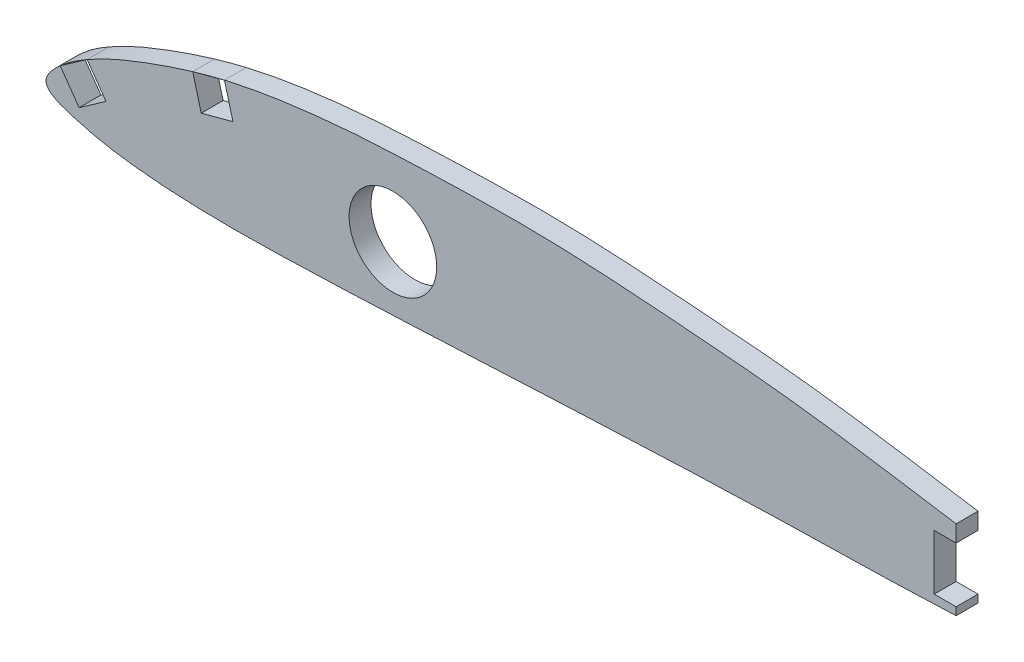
ISO-10303-21;
HEADER;
FILE_DESCRIPTION(('STEP AP214'),'2;1');
FILE_NAME('part.step','',(''),(''),'','','');
FILE_SCHEMA(('AUTOMOTIVE_DESIGN { 1 0 10303 214 1 1 1 1 }'));
ENDSEC;
DATA;
#1=APPLICATION_CONTEXT('core data for automotive mechanical design processes');
#2=APPLICATION_PROTOCOL_DEFINITION('international standard','automotive_design',2000,#1);
#3=PRODUCT_CONTEXT('',#1,'mechanical');
#4=PRODUCT('Part','Part','',(#3));
#5=PRODUCT_RELATED_PRODUCT_CATEGORY('part','',(#4));
#6=PRODUCT_DEFINITION_FORMATION('','',#4);
#7=PRODUCT_DEFINITION_CONTEXT('part definition',#1,'design');
#8=PRODUCT_DEFINITION('design','',#6,#7);
#9=PRODUCT_DEFINITION_SHAPE('','',#8);
#10=(LENGTH_UNIT() NAMED_UNIT(*) SI_UNIT(.MILLI.,.METRE.));
#11=(NAMED_UNIT(*) PLANE_ANGLE_UNIT() SI_UNIT($,.RADIAN.));
#12=(NAMED_UNIT(*) SI_UNIT($,.STERADIAN.) SOLID_ANGLE_UNIT());
#13=UNCERTAINTY_MEASURE_WITH_UNIT(LENGTH_MEASURE(1.E-05),#10,'distance_accuracy_value','');
#14=(GEOMETRIC_REPRESENTATION_CONTEXT(3) GLOBAL_UNCERTAINTY_ASSIGNED_CONTEXT((#13)) GLOBAL_UNIT_ASSIGNED_CONTEXT((#10,
#11,#12)) REPRESENTATION_CONTEXT('',''));
#15=CARTESIAN_POINT('',(0.,0.,0.));
#16=DIRECTION('',(0.,0.,1.));
#17=DIRECTION('',(1.,0.,0.));
#18=AXIS2_PLACEMENT_3D('',#15,#16,#17);
#19=CARTESIAN_POINT('',(0.,0.,0.));
#20=DIRECTION('',(0.,0.,-1.));
#21=DIRECTION('',(-1.,0.,0.));
#22=AXIS2_PLACEMENT_3D('',#19,#20,#21);
#23=PLANE('',#22);
#24=DIRECTION('',(0.,1.,0.));
#25=VECTOR('',#24,1.);
#26=CARTESIAN_POINT('',(131.992,0.,0.));
#27=LINE('',#26,#25);
#28=CARTESIAN_POINT('',(131.992,7.99999999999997,0.));
#29=VERTEX_POINT('',#28);
#30=CARTESIAN_POINT('',(131.992,10.419422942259,0.));
#31=VERTEX_POINT('',#30);
#32=EDGE_CURVE('E201',#29,#31,#27,.T.);
#33=ORIENTED_EDGE('',*,*,#32,.F.);
#34=DIRECTION('',(1.,0.,0.));
#35=VECTOR('',#34,1.);
#36=CARTESIAN_POINT('',(0.,7.99999999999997,0.));
#37=LINE('',#36,#35);
#38=CARTESIAN_POINT('',(128.817,7.99999999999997,0.));
#39=VERTEX_POINT('',#38);
#40=EDGE_CURVE('E64',#39,#29,#37,.T.);
#41=ORIENTED_EDGE('',*,*,#40,.F.);
#42=DIRECTION('',(0.,1.,0.));
#43=VECTOR('',#42,1.);
#44=CARTESIAN_POINT('',(128.817,0.,0.));
#45=LINE('',#44,#43);
#46=CARTESIAN_POINT('',(128.817,0.,0.));
#47=VERTEX_POINT('',#46);
#48=EDGE_CURVE('E190',#47,#39,#45,.T.);
#49=ORIENTED_EDGE('',*,*,#48,.F.);
#50=DIRECTION('',(-1.,0.,0.));
#51=VECTOR('',#50,1.);
#52=CARTESIAN_POINT('',(0.,0.,0.));
#53=LINE('',#52,#51);
#54=CARTESIAN_POINT('',(131.992,0.,0.));
#55=VERTEX_POINT('',#54);
#56=EDGE_CURVE('E133',#55,#47,#53,.T.);
#57=ORIENTED_EDGE('',*,*,#56,.F.);
#58=DIRECTION('',(0.,1.,0.));
#59=VECTOR('',#58,1.);
#60=CARTESIAN_POINT('',(131.992,0.,0.));
#61=LINE('',#60,#59);
#62=CARTESIAN_POINT('',(131.992,-1.12472959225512,0.));
#63=VERTEX_POINT('',#62);
#64=EDGE_CURVE('E196',#63,#55,#61,.T.);
#65=ORIENTED_EDGE('',*,*,#64,.F.);
#66=CARTESIAN_POINT('',(0.,0.,0.));
#67=CARTESIAN_POINT('',(-0.0497615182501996,0.966343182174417,0.));
#68=CARTESIAN_POINT('',(2.06035689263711,3.13560254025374,0.));
#69=CARTESIAN_POINT('',(5.05737649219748,5.28209114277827,0.));
#70=CARTESIAN_POINT('',(8.94173703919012,7.37378373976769,0.));
#71=CARTESIAN_POINT('',(16.3804299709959,10.3996324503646,0.));
#72=CARTESIAN_POINT('',(25.4040046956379,13.2786446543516,0.));
#73=CARTESIAN_POINT('',(36.0853642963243,14.9867828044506,0.));
#74=CARTESIAN_POINT('',(45.1384362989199,15.8902490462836,0.));
#75=CARTESIAN_POINT('',(57.1889611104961,16.3952873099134,0.));
#76=CARTESIAN_POINT('',(72.2672780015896,16.822951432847,0.));
#77=CARTESIAN_POINT('',(90.3138876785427,15.5563635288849,0.));
#78=CARTESIAN_POINT('',(108.490792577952,14.1400208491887,0.));
#79=CARTESIAN_POINT('',(126.255248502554,11.2942907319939,0.));
#80=CARTESIAN_POINT('',(145.311705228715,8.38102536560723,0.));
#81=CARTESIAN_POINT('',(159.854892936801,4.95966623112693,0.));
#82=CARTESIAN_POINT('',(190.812648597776,-1.1725038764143,0.));
#83=CARTESIAN_POINT('',(150.756480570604,0.23836985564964,0.));
#84=CARTESIAN_POINT('',(133.337000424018,-1.35578957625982,0.));
#85=CARTESIAN_POINT('',(95.7330391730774,-1.94857406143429,0.));
#86=CARTESIAN_POINT('',(66.3381494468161,-3.55026856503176,0.));
#87=CARTESIAN_POINT('',(36.0734980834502,-4.86947617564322,0.));
#88=CARTESIAN_POINT('',(21.2000389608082,-5.11335903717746,0.));
#89=CARTESIAN_POINT('',(10.2524510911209,-4.05305199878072,0.));
#90=CARTESIAN_POINT('',(4.67919825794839,-2.77873170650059,0.));
#91=CARTESIAN_POINT('',(0.0682857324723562,-1.32607392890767,0.));
#92=CARTESIAN_POINT('',(0.,0.,0.));
#93=B_SPLINE_CURVE_WITH_KNOTS('',3,(#66,#67,#68,#69,#70,#71,#72,#73,#74,#75,#76,#77,#78,#79,#80,
#81,#82,#83,#84,#85,#86,#87,#88,#89,#90,#91,#92),.UNSPECIFIED.,.T.,.F.,(4,1,1,1,1,1,1,1,1,1,1,1,
1,1,1,1,1,1,1,1,1,1,1,1,4),(0.,0.0105604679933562,0.0182111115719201,0.0322098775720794,
0.0455249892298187,0.0840694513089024,0.10897429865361,0.133649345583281,0.158232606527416,
0.207343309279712,0.25652270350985,0.30582635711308,0.355445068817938,0.40521420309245,
0.4553904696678,0.506006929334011,0.555121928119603,0.653369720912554,0.702490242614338,
0.849938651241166,0.899083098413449,0.948194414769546,0.972905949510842,0.985508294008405,1.),.UNSPECIFIED.);
#94=CARTESIAN_POINT('',(2.0644061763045,2.99155451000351,0.));
#95=VERTEX_POINT('',#94);
#96=EDGE_CURVE('E205',#63,#95,#93,.T.);
#97=ORIENTED_EDGE('',*,*,#96,.T.);
#98=DIRECTION('',(-0.573576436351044,0.819152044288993,0.));
#99=VECTOR('',#98,1.);
#100=CARTESIAN_POINT('',(2.79080818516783,1.95414492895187,0.));
#101=LINE('',#100,#99);
#102=CARTESIAN_POINT('',(4.79606395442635,-0.909657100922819,0.));
#103=VERTEX_POINT('',#102);
#104=EDGE_CURVE('E159',#103,#95,#101,.T.);
#105=ORIENTED_EDGE('',*,*,#104,.F.);
#106=DIRECTION('',(-0.819152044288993,-0.573576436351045,0.));
#107=VECTOR('',#106,1.);
#108=CARTESIAN_POINT('',(2.00525576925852,-2.86380202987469,0.));
#109=LINE('',#108,#107);
#110=CARTESIAN_POINT('',(8.69727556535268,1.82200067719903,0.));
#111=VERTEX_POINT('',#110);
#112=EDGE_CURVE('E248',#111,#103,#109,.T.);
#113=ORIENTED_EDGE('',*,*,#112,.F.);
#114=DIRECTION('',(0.573576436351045,-0.819152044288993,0.));
#115=VECTOR('',#114,1.);
#116=CARTESIAN_POINT('',(6.69201979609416,4.68580270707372,0.));
#117=LINE('',#116,#115);
#118=CARTESIAN_POINT('',(5.96561778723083,5.72321228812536,0.));
#119=VERTEX_POINT('',#118);
#120=EDGE_CURVE('E179',#119,#111,#117,.T.);
#121=ORIENTED_EDGE('',*,*,#120,.F.);
#122=CARTESIAN_POINT('',(21.2823260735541,11.8553995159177,0.));
#123=VERTEX_POINT('',#122);
#124=EDGE_CURVE('E210',#119,#123,#93,.T.);
#125=ORIENTED_EDGE('',*,*,#124,.T.);
#126=DIRECTION('',(-0.258819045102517,0.965925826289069,0.));
#127=VECTOR('',#126,1.);
#128=CARTESIAN_POINT('',(22.8205304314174,6.11474269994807,0.));
#129=LINE('',#128,#127);
#130=CARTESIAN_POINT('',(22.5149517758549,7.25517776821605,0.));
#131=VERTEX_POINT('',#130);
#132=EDGE_CURVE('E237',#131,#123,#129,.T.);
#133=ORIENTED_EDGE('',*,*,#132,.F.);
#134=DIRECTION('',(-0.965925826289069,-0.258819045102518,0.));
#135=VECTOR('',#134,1.);
#136=CARTESIAN_POINT('',(-0.30557865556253,1.14043506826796,0.));
#137=LINE('',#136,#135);
#138=CARTESIAN_POINT('',(27.1151735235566,8.4878034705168,0.));
#139=VERTEX_POINT('',#138);
#140=EDGE_CURVE('E252',#139,#131,#137,.T.);
#141=ORIENTED_EDGE('',*,*,#140,.F.);
#142=DIRECTION('',(0.258819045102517,-0.965925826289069,0.));
#143=VECTOR('',#142,1.);
#144=CARTESIAN_POINT('',(27.4207521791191,7.34736840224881,0.));
#145=LINE('',#144,#143);
#146=CARTESIAN_POINT('',(25.8825478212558,13.0880252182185,0.));
#147=VERTEX_POINT('',#146);
#148=EDGE_CURVE('E261',#147,#139,#145,.T.);
#149=ORIENTED_EDGE('',*,*,#148,.F.);
#150=EDGE_CURVE('E211',#147,#31,#93,.T.);
#151=ORIENTED_EDGE('',*,*,#150,.T.);
#152=EDGE_LOOP('',(#33,#41,#49,#57,#65,#97,#105,#113,#121,#125,#133,#141,#149,#151));
#153=FACE_BOUND('',#152,.T.);
#154=CARTESIAN_POINT('',(50.31,4.99999999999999,0.));
#155=DIRECTION('',(0.,0.,-1.));
#156=DIRECTION('',(-1.,0.,0.));
#157=AXIS2_PLACEMENT_3D('',#154,#155,#156);
#158=CIRCLE('',#157,6.35);
#159=CARTESIAN_POINT('',(43.96,4.99999999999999,0.));
#160=VERTEX_POINT('',#159);
#161=EDGE_CURVE('E238',#160,#160,#158,.T.);
#162=ORIENTED_EDGE('',*,*,#161,.F.);
#163=EDGE_LOOP('',(#162));
#164=FACE_BOUND('',#163,.T.);
#165=ADVANCED_FACE('F44',(#153,#164),#23,.T.);
#166=CARTESIAN_POINT('',(0.,0.,3.175));
#167=DIRECTION('',(0.,0.,-1.));
#168=DIRECTION('',(-1.,0.,0.));
#169=AXIS2_PLACEMENT_3D('',#166,#167,#168);
#170=PLANE('',#169);
#171=CARTESIAN_POINT('',(50.31,4.99999999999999,3.175));
#172=DIRECTION('',(0.,0.,1.));
#173=DIRECTION('',(1.,0.,0.));
#174=AXIS2_PLACEMENT_3D('',#171,#172,#173);
#175=CIRCLE('',#174,6.35);
#176=CARTESIAN_POINT('',(56.66,4.99999999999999,3.175));
#177=VERTEX_POINT('',#176);
#178=EDGE_CURVE('E235',#177,#177,#175,.T.);
#179=ORIENTED_EDGE('',*,*,#178,.F.);
#180=EDGE_LOOP('',(#179));
#181=FACE_BOUND('',#180,.T.);
#182=DIRECTION('',(-1.,0.,0.));
#183=VECTOR('',#182,1.);
#184=CARTESIAN_POINT('',(128.817,7.99999999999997,3.175));
#185=LINE('',#184,#183);
#186=CARTESIAN_POINT('',(131.992,7.99999999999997,3.175));
#187=VERTEX_POINT('',#186);
#188=CARTESIAN_POINT('',(128.817,7.99999999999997,3.175));
#189=VERTEX_POINT('',#188);
#190=EDGE_CURVE('E13',#187,#189,#185,.T.);
#191=ORIENTED_EDGE('',*,*,#190,.F.);
#192=DIRECTION('',(0.,-1.,0.));
#193=VECTOR('',#192,1.);
#194=CARTESIAN_POINT('',(131.992,16.0032119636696,3.175));
#195=LINE('',#194,#193);
#196=CARTESIAN_POINT('',(131.992,10.419422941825,3.175));
#197=VERTEX_POINT('',#196);
#198=EDGE_CURVE('E200',#197,#187,#195,.T.);
#199=ORIENTED_EDGE('',*,*,#198,.F.);
#200=CARTESIAN_POINT('',(0.,0.,3.175));
#201=CARTESIAN_POINT('',(-0.0497615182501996,0.966343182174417,3.175));
#202=CARTESIAN_POINT('',(2.06035689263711,3.13560254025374,3.175));
#203=CARTESIAN_POINT('',(5.05737649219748,5.28209114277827,3.175));
#204=CARTESIAN_POINT('',(8.94173703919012,7.37378373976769,3.175));
#205=CARTESIAN_POINT('',(16.3804299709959,10.3996324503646,3.175));
#206=CARTESIAN_POINT('',(25.4040046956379,13.2786446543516,3.175));
#207=CARTESIAN_POINT('',(36.0853642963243,14.9867828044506,3.175));
#208=CARTESIAN_POINT('',(45.1384362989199,15.8902490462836,3.175));
#209=CARTESIAN_POINT('',(57.1889611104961,16.3952873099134,3.175));
#210=CARTESIAN_POINT('',(72.2672780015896,16.822951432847,3.175));
#211=CARTESIAN_POINT('',(90.3138876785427,15.5563635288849,3.175));
#212=CARTESIAN_POINT('',(108.490792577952,14.1400208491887,3.175));
#213=CARTESIAN_POINT('',(126.255248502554,11.2942907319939,3.175));
#214=CARTESIAN_POINT('',(145.311705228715,8.38102536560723,3.175));
#215=CARTESIAN_POINT('',(159.854892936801,4.95966623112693,3.175));
#216=CARTESIAN_POINT('',(190.812648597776,-1.1725038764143,3.175));
#217=CARTESIAN_POINT('',(150.756480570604,0.23836985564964,3.175));
#218=CARTESIAN_POINT('',(133.337000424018,-1.35578957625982,3.175));
#219=CARTESIAN_POINT('',(95.7330391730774,-1.94857406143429,3.175));
#220=CARTESIAN_POINT('',(66.3381494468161,-3.55026856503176,3.175));
#221=CARTESIAN_POINT('',(36.0734980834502,-4.86947617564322,3.175));
#222=CARTESIAN_POINT('',(21.2000389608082,-5.11335903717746,3.175));
#223=CARTESIAN_POINT('',(10.2524510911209,-4.05305199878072,3.175));
#224=CARTESIAN_POINT('',(4.67919825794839,-2.77873170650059,3.175));
#225=CARTESIAN_POINT('',(0.0682857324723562,-1.32607392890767,3.175));
#226=CARTESIAN_POINT('',(0.,0.,3.175));
#227=B_SPLINE_CURVE_WITH_KNOTS('',3,(#200,#201,#202,#203,#204,#205,#206,#207,#208,#209,#210,
#211,#212,#213,#214,#215,#216,#217,#218,#219,#220,#221,#222,#223,#224,#225,#226),.UNSPECIFIED.,
.T.,.F.,(4,1,1,1,1,1,1,1,1,1,1,1,1,1,1,1,1,1,1,1,1,1,1,1,4),(0.,0.0105604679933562,
0.0182111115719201,0.0322098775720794,0.0455249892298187,0.0840694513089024,0.10897429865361,
0.133649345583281,0.158232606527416,0.207343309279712,0.25652270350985,0.30582635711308,
0.355445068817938,0.40521420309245,0.4553904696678,0.506006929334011,0.555121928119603,
0.653369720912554,0.702490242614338,0.849938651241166,0.899083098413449,0.948194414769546,
0.972905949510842,0.985508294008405,1.),.UNSPECIFIED.);
#228=CARTESIAN_POINT('',(25.8825478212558,13.0880252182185,3.175));
#229=VERTEX_POINT('',#228);
#230=EDGE_CURVE('E172',#229,#197,#227,.T.);
#231=ORIENTED_EDGE('',*,*,#230,.F.);
#232=DIRECTION('',(-0.258819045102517,0.965925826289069,0.));
#233=VECTOR('',#232,1.);
#234=CARTESIAN_POINT('',(25.8825478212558,13.0880252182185,3.175));
#235=LINE('',#234,#233);
#236=CARTESIAN_POINT('',(27.1151735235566,8.4878034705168,3.175));
#237=VERTEX_POINT('',#236);
#238=EDGE_CURVE('E255',#237,#229,#235,.T.);
#239=ORIENTED_EDGE('',*,*,#238,.F.);
#240=DIRECTION('',(0.965925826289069,0.258819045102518,0.));
#241=VECTOR('',#240,1.);
#242=CARTESIAN_POINT('',(22.5149517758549,7.25517776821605,3.175));
#243=LINE('',#242,#241);
#244=CARTESIAN_POINT('',(22.5149517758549,7.25517776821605,3.175));
#245=VERTEX_POINT('',#244);
#246=EDGE_CURVE('E259',#245,#237,#243,.T.);
#247=ORIENTED_EDGE('',*,*,#246,.F.);
#248=DIRECTION('',(0.258819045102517,-0.965925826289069,0.));
#249=VECTOR('',#248,1.);
#250=CARTESIAN_POINT('',(21.2823260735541,11.8553995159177,3.175));
#251=LINE('',#250,#249);
#252=CARTESIAN_POINT('',(21.2823260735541,11.8553995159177,3.175));
#253=VERTEX_POINT('',#252);
#254=EDGE_CURVE('E264',#253,#245,#251,.T.);
#255=ORIENTED_EDGE('',*,*,#254,.F.);
#256=CARTESIAN_POINT('',(5.96561778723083,5.72321228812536,3.175));
#257=VERTEX_POINT('',#256);
#258=EDGE_CURVE('E173',#257,#253,#227,.T.);
#259=ORIENTED_EDGE('',*,*,#258,.F.);
#260=DIRECTION('',(-0.573576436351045,0.819152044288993,0.));
#261=VECTOR('',#260,1.);
#262=CARTESIAN_POINT('',(5.96561778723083,5.72321228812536,3.175));
#263=LINE('',#262,#261);
#264=CARTESIAN_POINT('',(8.69727556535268,1.82200067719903,3.175));
#265=VERTEX_POINT('',#264);
#266=EDGE_CURVE('E251',#265,#257,#263,.T.);
#267=ORIENTED_EDGE('',*,*,#266,.F.);
#268=DIRECTION('',(0.819152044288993,0.573576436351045,0.));
#269=VECTOR('',#268,1.);
#270=CARTESIAN_POINT('',(4.79606395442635,-0.909657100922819,3.175));
#271=LINE('',#270,#269);
#272=CARTESIAN_POINT('',(4.79606395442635,-0.909657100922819,3.175));
#273=VERTEX_POINT('',#272);
#274=EDGE_CURVE('E178',#273,#265,#271,.T.);
#275=ORIENTED_EDGE('',*,*,#274,.F.);
#276=DIRECTION('',(0.573576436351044,-0.819152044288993,0.));
#277=VECTOR('',#276,1.);
#278=CARTESIAN_POINT('',(2.0644061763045,2.99155451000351,3.175));
#279=LINE('',#278,#277);
#280=CARTESIAN_POINT('',(2.0644061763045,2.99155451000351,3.175));
#281=VERTEX_POINT('',#280);
#282=EDGE_CURVE('E156',#281,#273,#279,.T.);
#283=ORIENTED_EDGE('',*,*,#282,.F.);
#284=CARTESIAN_POINT('',(131.992000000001,-1.12472959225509,3.175));
#285=VERTEX_POINT('',#284);
#286=EDGE_CURVE('E166',#285,#281,#227,.T.);
#287=ORIENTED_EDGE('',*,*,#286,.F.);
#288=DIRECTION('',(0.,-1.,0.));
#289=VECTOR('',#288,1.);
#290=CARTESIAN_POINT('',(131.992,0.,3.175));
#291=LINE('',#290,#289);
#292=CARTESIAN_POINT('',(131.992,0.,3.175));
#293=VERTEX_POINT('',#292);
#294=EDGE_CURVE('E195',#293,#285,#291,.T.);
#295=ORIENTED_EDGE('',*,*,#294,.F.);
#296=DIRECTION('',(1.,0.,0.));
#297=VECTOR('',#296,1.);
#298=CARTESIAN_POINT('',(128.817,0.,3.175));
#299=LINE('',#298,#297);
#300=CARTESIAN_POINT('',(128.817,0.,3.175));
#301=VERTEX_POINT('',#300);
#302=EDGE_CURVE('E192',#301,#293,#299,.T.);
#303=ORIENTED_EDGE('',*,*,#302,.F.);
#304=DIRECTION('',(0.,-1.,0.));
#305=VECTOR('',#304,1.);
#306=CARTESIAN_POINT('',(128.817,7.99999999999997,3.175));
#307=LINE('',#306,#305);
#308=EDGE_CURVE('E189',#189,#301,#307,.T.);
#309=ORIENTED_EDGE('',*,*,#308,.F.);
#310=EDGE_LOOP('',(#191,#199,#231,#239,#247,#255,#259,#267,#275,#283,#287,#295,#303,#309));
#311=FACE_BOUND('',#310,.T.);
#312=ADVANCED_FACE('F175',(#181,#311),#170,.F.);
#313=DIRECTION('',(0.,0.,1.));
#314=VECTOR('',#313,1.);
#315=SURFACE_OF_LINEAR_EXTRUSION('',#93,#314);
#316=ORIENTED_EDGE('',*,*,#230,.T.);
#317=DIRECTION('',(0.,0.,1.));
#318=VECTOR('',#317,1.);
#319=CARTESIAN_POINT('',(131.992,10.419422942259,0.));
#320=LINE('',#319,#318);
#321=EDGE_CURVE('E287',#197,#31,#320,.F.);
#322=ORIENTED_EDGE('',*,*,#321,.T.);
#323=ORIENTED_EDGE('',*,*,#150,.F.);
#324=DIRECTION('',(0.,0.,1.));
#325=VECTOR('',#324,1.);
#326=CARTESIAN_POINT('',(25.8825478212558,13.0880252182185,0.));
#327=LINE('',#326,#325);
#328=EDGE_CURVE('E212',#147,#229,#327,.T.);
#329=ORIENTED_EDGE('',*,*,#328,.T.);
#330=EDGE_LOOP('',(#316,#322,#323,#329));
#331=FACE_BOUND('',#330,.T.);
#332=ADVANCED_FACE('F222',(#331),#315,.F.);
#333=ORIENTED_EDGE('',*,*,#96,.F.);
#334=DIRECTION('',(0.,0.,1.));
#335=VECTOR('',#334,1.);
#336=CARTESIAN_POINT('',(131.992,-1.12472959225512,0.));
#337=LINE('',#336,#335);
#338=EDGE_CURVE('E168',#63,#285,#337,.T.);
#339=ORIENTED_EDGE('',*,*,#338,.T.);
#340=ORIENTED_EDGE('',*,*,#286,.T.);
#341=DIRECTION('',(0.,0.,1.));
#342=VECTOR('',#341,1.);
#343=CARTESIAN_POINT('',(2.06440617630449,2.9915545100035,0.));
#344=LINE('',#343,#342);
#345=EDGE_CURVE('E151',#95,#281,#344,.T.);
#346=ORIENTED_EDGE('',*,*,#345,.F.);
#347=EDGE_LOOP('',(#333,#339,#340,#346));
#348=FACE_BOUND('',#347,.T.);
#349=ADVANCED_FACE('F167',(#348),#315,.F.);
#350=ORIENTED_EDGE('',*,*,#124,.F.);
#351=DIRECTION('',(0.,0.,1.));
#352=VECTOR('',#351,1.);
#353=CARTESIAN_POINT('',(5.96561778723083,5.72321228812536,0.));
#354=LINE('',#353,#352);
#355=EDGE_CURVE('E171',#119,#257,#354,.T.);
#356=ORIENTED_EDGE('',*,*,#355,.T.);
#357=ORIENTED_EDGE('',*,*,#258,.T.);
#358=DIRECTION('',(0.,0.,1.));
#359=VECTOR('',#358,1.);
#360=CARTESIAN_POINT('',(21.2823260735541,11.8553995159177,0.));
#361=LINE('',#360,#359);
#362=EDGE_CURVE('E47',#123,#253,#361,.T.);
#363=ORIENTED_EDGE('',*,*,#362,.F.);
#364=EDGE_LOOP('',(#350,#356,#357,#363));
#365=FACE_BOUND('',#364,.T.);
#366=ADVANCED_FACE('F217',(#365),#315,.F.);
#367=CARTESIAN_POINT('',(50.31,4.99999999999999,-6.825));
#368=DIRECTION('',(0.,0.,1.));
#369=DIRECTION('',(1.,0.,0.));
#370=AXIS2_PLACEMENT_3D('',#367,#368,#369);
#371=CYLINDRICAL_SURFACE('',#370,6.35);
#372=ORIENTED_EDGE('',*,*,#161,.T.);
#373=EDGE_LOOP('',(#372));
#374=FACE_BOUND('',#373,.T.);
#375=ORIENTED_EDGE('',*,*,#178,.T.);
#376=EDGE_LOOP('',(#375));
#377=FACE_BOUND('',#376,.T.);
#378=ADVANCED_FACE('F220',(#374,#377),#371,.F.);
#379=CARTESIAN_POINT('',(21.2823260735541,11.8553995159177,-6.825));
#380=DIRECTION('',(-0.965925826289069,-0.258819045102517,0.));
#381=DIRECTION('',(0.258819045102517,-0.965925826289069,0.));
#382=AXIS2_PLACEMENT_3D('',#379,#380,#381);
#383=PLANE('',#382);
#384=ORIENTED_EDGE('',*,*,#132,.T.);
#385=ORIENTED_EDGE('',*,*,#362,.T.);
#386=ORIENTED_EDGE('',*,*,#254,.T.);
#387=DIRECTION('',(0.,0.,1.));
#388=VECTOR('',#387,1.);
#389=CARTESIAN_POINT('',(22.5149517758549,7.25517776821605,-6.825));
#390=LINE('',#389,#388);
#391=EDGE_CURVE('E254',#131,#245,#390,.T.);
#392=ORIENTED_EDGE('',*,*,#391,.F.);
#393=EDGE_LOOP('',(#384,#385,#386,#392));
#394=FACE_BOUND('',#393,.T.);
#395=ADVANCED_FACE('F341',(#394),#383,.F.);
#396=CARTESIAN_POINT('',(25.8825478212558,13.0880252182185,-6.825));
#397=DIRECTION('',(0.965925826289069,0.258819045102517,0.));
#398=DIRECTION('',(-0.258819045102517,0.965925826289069,0.));
#399=AXIS2_PLACEMENT_3D('',#396,#397,#398);
#400=PLANE('',#399);
#401=ORIENTED_EDGE('',*,*,#148,.T.);
#402=DIRECTION('',(0.,0.,1.));
#403=VECTOR('',#402,1.);
#404=CARTESIAN_POINT('',(27.1151735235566,8.4878034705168,-6.825));
#405=LINE('',#404,#403);
#406=EDGE_CURVE('E263',#139,#237,#405,.T.);
#407=ORIENTED_EDGE('',*,*,#406,.T.);
#408=ORIENTED_EDGE('',*,*,#238,.T.);
#409=ORIENTED_EDGE('',*,*,#328,.F.);
#410=EDGE_LOOP('',(#401,#407,#408,#409));
#411=FACE_BOUND('',#410,.T.);
#412=ADVANCED_FACE('F335',(#411),#400,.F.);
#413=CARTESIAN_POINT('',(22.5149517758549,7.25517776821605,-6.825));
#414=DIRECTION('',(0.258819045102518,-0.965925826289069,0.));
#415=DIRECTION('',(0.965925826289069,0.258819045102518,0.));
#416=AXIS2_PLACEMENT_3D('',#413,#414,#415);
#417=PLANE('',#416);
#418=ORIENTED_EDGE('',*,*,#140,.T.);
#419=ORIENTED_EDGE('',*,*,#391,.T.);
#420=ORIENTED_EDGE('',*,*,#246,.T.);
#421=ORIENTED_EDGE('',*,*,#406,.F.);
#422=EDGE_LOOP('',(#418,#419,#420,#421));
#423=FACE_BOUND('',#422,.T.);
#424=ADVANCED_FACE('F337',(#423),#417,.F.);
#425=CARTESIAN_POINT('',(2.0644061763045,2.99155451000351,-6.825));
#426=DIRECTION('',(-0.819152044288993,-0.573576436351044,0.));
#427=DIRECTION('',(0.573576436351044,-0.819152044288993,0.));
#428=AXIS2_PLACEMENT_3D('',#425,#426,#427);
#429=PLANE('',#428);
#430=ORIENTED_EDGE('',*,*,#104,.T.);
#431=ORIENTED_EDGE('',*,*,#345,.T.);
#432=ORIENTED_EDGE('',*,*,#282,.T.);
#433=DIRECTION('',(0.,0.,1.));
#434=VECTOR('',#433,1.);
#435=CARTESIAN_POINT('',(4.79606395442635,-0.909657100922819,-6.825));
#436=LINE('',#435,#434);
#437=EDGE_CURVE('E250',#103,#273,#436,.T.);
#438=ORIENTED_EDGE('',*,*,#437,.F.);
#439=EDGE_LOOP('',(#430,#431,#432,#438));
#440=FACE_BOUND('',#439,.T.);
#441=ADVANCED_FACE('F153',(#440),#429,.F.);
#442=CARTESIAN_POINT('',(5.96561778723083,5.72321228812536,-6.825));
#443=DIRECTION('',(0.819152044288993,0.573576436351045,0.));
#444=DIRECTION('',(-0.573576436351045,0.819152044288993,0.));
#445=AXIS2_PLACEMENT_3D('',#442,#443,#444);
#446=PLANE('',#445);
#447=ORIENTED_EDGE('',*,*,#120,.T.);
#448=DIRECTION('',(0.,0.,1.));
#449=VECTOR('',#448,1.);
#450=CARTESIAN_POINT('',(8.69727556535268,1.82200067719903,-6.825));
#451=LINE('',#450,#449);
#452=EDGE_CURVE('E181',#111,#265,#451,.T.);
#453=ORIENTED_EDGE('',*,*,#452,.T.);
#454=ORIENTED_EDGE('',*,*,#266,.T.);
#455=ORIENTED_EDGE('',*,*,#355,.F.);
#456=EDGE_LOOP('',(#447,#453,#454,#455));
#457=FACE_BOUND('',#456,.T.);
#458=ADVANCED_FACE('F274',(#457),#446,.F.);
#459=CARTESIAN_POINT('',(4.79606395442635,-0.909657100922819,-6.825));
#460=DIRECTION('',(0.573576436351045,-0.819152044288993,0.));
#461=DIRECTION('',(0.819152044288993,0.573576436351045,0.));
#462=AXIS2_PLACEMENT_3D('',#459,#460,#461);
#463=PLANE('',#462);
#464=ORIENTED_EDGE('',*,*,#112,.T.);
#465=ORIENTED_EDGE('',*,*,#437,.T.);
#466=ORIENTED_EDGE('',*,*,#274,.T.);
#467=ORIENTED_EDGE('',*,*,#452,.F.);
#468=EDGE_LOOP('',(#464,#465,#466,#467));
#469=FACE_BOUND('',#468,.T.);
#470=ADVANCED_FACE('F301',(#469),#463,.F.);
#471=CARTESIAN_POINT('',(131.992,16.0032119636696,-6.825));
#472=DIRECTION('',(-1.,0.,0.));
#473=DIRECTION('',(0.,0.,1.));
#474=AXIS2_PLACEMENT_3D('',#471,#472,#473);
#475=PLANE('',#474);
#476=ORIENTED_EDGE('',*,*,#32,.T.);
#477=ORIENTED_EDGE('',*,*,#321,.F.);
#478=ORIENTED_EDGE('',*,*,#198,.T.);
#479=DIRECTION('',(0.,0.,1.));
#480=VECTOR('',#479,1.);
#481=CARTESIAN_POINT('',(131.992,7.99999999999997,-6.825));
#482=LINE('',#481,#480);
#483=EDGE_CURVE('E52',#29,#187,#482,.T.);
#484=ORIENTED_EDGE('',*,*,#483,.F.);
#485=EDGE_LOOP('',(#476,#477,#478,#484));
#486=FACE_BOUND('',#485,.T.);
#487=ADVANCED_FACE('F319',(#486),#475,.F.);
#488=CARTESIAN_POINT('',(131.992,0.,-6.825));
#489=DIRECTION('',(-1.,0.,0.));
#490=DIRECTION('',(0.,0.,1.));
#491=AXIS2_PLACEMENT_3D('',#488,#489,#490);
#492=PLANE('',#491);
#493=ORIENTED_EDGE('',*,*,#64,.T.);
#494=DIRECTION('',(0.,0.,1.));
#495=VECTOR('',#494,1.);
#496=CARTESIAN_POINT('',(131.992,0.,-6.825));
#497=LINE('',#496,#495);
#498=EDGE_CURVE('E193',#55,#293,#497,.T.);
#499=ORIENTED_EDGE('',*,*,#498,.T.);
#500=ORIENTED_EDGE('',*,*,#294,.T.);
#501=ORIENTED_EDGE('',*,*,#338,.F.);
#502=EDGE_LOOP('',(#493,#499,#500,#501));
#503=FACE_BOUND('',#502,.T.);
#504=ADVANCED_FACE('F223',(#503),#492,.F.);
#505=CARTESIAN_POINT('',(128.817,0.,-6.825));
#506=DIRECTION('',(0.,-1.,0.));
#507=DIRECTION('',(1.,0.,0.));
#508=AXIS2_PLACEMENT_3D('',#505,#506,#507);
#509=PLANE('',#508);
#510=ORIENTED_EDGE('',*,*,#56,.T.);
#511=DIRECTION('',(0.,0.,1.));
#512=VECTOR('',#511,1.);
#513=CARTESIAN_POINT('',(128.817,0.,-6.825));
#514=LINE('',#513,#512);
#515=EDGE_CURVE('E127',#47,#301,#514,.T.);
#516=ORIENTED_EDGE('',*,*,#515,.T.);
#517=ORIENTED_EDGE('',*,*,#302,.T.);
#518=ORIENTED_EDGE('',*,*,#498,.F.);
#519=EDGE_LOOP('',(#510,#516,#517,#518));
#520=FACE_BOUND('',#519,.T.);
#521=ADVANCED_FACE('F305',(#520),#509,.F.);
#522=CARTESIAN_POINT('',(128.817,7.99999999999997,-6.825));
#523=DIRECTION('',(-1.,0.,0.));
#524=DIRECTION('',(0.,0.,1.));
#525=AXIS2_PLACEMENT_3D('',#522,#523,#524);
#526=PLANE('',#525);
#527=ORIENTED_EDGE('',*,*,#48,.T.);
#528=DIRECTION('',(0.,0.,1.));
#529=VECTOR('',#528,1.);
#530=CARTESIAN_POINT('',(128.817,7.99999999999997,-6.825));
#531=LINE('',#530,#529);
#532=EDGE_CURVE('E187',#39,#189,#531,.T.);
#533=ORIENTED_EDGE('',*,*,#532,.T.);
#534=ORIENTED_EDGE('',*,*,#308,.T.);
#535=ORIENTED_EDGE('',*,*,#515,.F.);
#536=EDGE_LOOP('',(#527,#533,#534,#535));
#537=FACE_BOUND('',#536,.T.);
#538=ADVANCED_FACE('F310',(#537),#526,.F.);
#539=CARTESIAN_POINT('',(128.817,7.99999999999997,-6.825));
#540=DIRECTION('',(0.,1.,0.));
#541=DIRECTION('',(0.,0.,1.));
#542=AXIS2_PLACEMENT_3D('',#539,#540,#541);
#543=PLANE('',#542);
#544=ORIENTED_EDGE('',*,*,#40,.T.);
#545=ORIENTED_EDGE('',*,*,#483,.T.);
#546=ORIENTED_EDGE('',*,*,#190,.T.);
#547=ORIENTED_EDGE('',*,*,#532,.F.);
#548=EDGE_LOOP('',(#544,#545,#546,#547));
#549=FACE_BOUND('',#548,.T.);
#550=ADVANCED_FACE('F311',(#549),#543,.F.);
#551=CLOSED_SHELL('',(#165,#312,#332,#349,#366,#378,#395,#412,#424,#441,#458,#470,#487,#504,
#521,#538,#550));
#552=MANIFOLD_SOLID_BREP('B2',#551);
#553=CARTESIAN_POINT('',(0.,0.,0.));
#554=CARTESIAN_POINT('',(-0.0497615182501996,0.966343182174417,0.));
#555=CARTESIAN_POINT('',(2.06035689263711,3.13560254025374,0.));
#556=CARTESIAN_POINT('',(5.05737649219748,5.28209114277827,0.));
#557=CARTESIAN_POINT('',(8.94173703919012,7.37378373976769,0.));
#558=CARTESIAN_POINT('',(16.3804299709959,10.3996324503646,0.));
#559=CARTESIAN_POINT('',(25.4040046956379,13.2786446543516,0.));
#560=CARTESIAN_POINT('',(36.0853642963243,14.9867828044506,0.));
#561=CARTESIAN_POINT('',(45.1384362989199,15.8902490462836,0.));
#562=CARTESIAN_POINT('',(57.1889611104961,16.3952873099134,0.));
#563=CARTESIAN_POINT('',(72.2672780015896,16.822951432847,0.));
#564=CARTESIAN_POINT('',(90.3138876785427,15.5563635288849,0.));
#565=CARTESIAN_POINT('',(108.490792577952,14.1400208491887,0.));
#566=CARTESIAN_POINT('',(126.255248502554,11.2942907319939,0.));
#567=CARTESIAN_POINT('',(145.311705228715,8.38102536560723,0.));
#568=CARTESIAN_POINT('',(159.854892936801,4.95966623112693,0.));
#569=CARTESIAN_POINT('',(190.812648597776,-1.1725038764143,0.));
#570=CARTESIAN_POINT('',(150.756480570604,0.23836985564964,0.));
#571=CARTESIAN_POINT('',(133.337000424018,-1.35578957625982,0.));
#572=CARTESIAN_POINT('',(95.7330391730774,-1.94857406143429,0.));
#573=CARTESIAN_POINT('',(66.3381494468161,-3.55026856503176,0.));
#574=CARTESIAN_POINT('',(36.0734980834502,-4.86947617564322,0.));
#575=CARTESIAN_POINT('',(21.2000389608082,-5.11335903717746,0.));
#576=CARTESIAN_POINT('',(10.2524510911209,-4.05305199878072,0.));
#577=CARTESIAN_POINT('',(4.67919825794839,-2.77873170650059,0.));
#578=CARTESIAN_POINT('',(0.0682857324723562,-1.32607392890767,0.));
#579=CARTESIAN_POINT('',(0.,0.,0.));
#580=B_SPLINE_CURVE_WITH_KNOTS('',3,(#553,#554,#555,#556,#557,#558,#559,#560,#561,#562,#563,
#564,#565,#566,#567,#568,#569,#570,#571,#572,#573,#574,#575,#576,#577,#578,#579),.UNSPECIFIED.,
.T.,.F.,(4,1,1,1,1,1,1,1,1,1,1,1,1,1,1,1,1,1,1,1,1,1,1,1,4),(0.,0.0105604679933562,
0.0182111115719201,0.0322098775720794,0.0455249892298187,0.0840694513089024,0.10897429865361,
0.133649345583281,0.158232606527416,0.207343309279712,0.25652270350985,0.30582635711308,
0.355445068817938,0.40521420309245,0.4553904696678,0.506006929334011,0.555121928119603,
0.653369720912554,0.702490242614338,0.849938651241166,0.899083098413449,0.948194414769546,
0.972905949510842,0.985508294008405,1.),.UNSPECIFIED.);
#581=DIRECTION('',(0.,0.,1.));
#582=VECTOR('',#581,1.);
#583=SURFACE_OF_LINEAR_EXTRUSION('',#580,#582);
#584=CARTESIAN_POINT('',(21.2823260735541,11.8553995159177,0.));
#585=VERTEX_POINT('',#584);
#586=CARTESIAN_POINT('',(25.8825478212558,13.0880252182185,0.));
#587=VERTEX_POINT('',#586);
#588=EDGE_CURVE('E494',#585,#587,#580,.T.);
#589=ORIENTED_EDGE('',*,*,#588,.F.);
#590=DIRECTION('',(0.,0.,1.));
#591=VECTOR('',#590,1.);
#592=CARTESIAN_POINT('',(21.2823260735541,11.8553995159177,0.));
#593=LINE('',#592,#591);
#594=CARTESIAN_POINT('',(21.2823260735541,11.8553995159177,3.175));
#595=VERTEX_POINT('',#594);
#596=EDGE_CURVE('E481',#585,#595,#593,.T.);
#597=ORIENTED_EDGE('',*,*,#596,.T.);
#598=CARTESIAN_POINT('',(0.,0.,3.175));
#599=CARTESIAN_POINT('',(-0.0497615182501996,0.966343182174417,3.175));
#600=CARTESIAN_POINT('',(2.06035689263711,3.13560254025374,3.175));
#601=CARTESIAN_POINT('',(5.05737649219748,5.28209114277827,3.175));
#602=CARTESIAN_POINT('',(8.94173703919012,7.37378373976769,3.175));
#603=CARTESIAN_POINT('',(16.3804299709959,10.3996324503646,3.175));
#604=CARTESIAN_POINT('',(25.4040046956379,13.2786446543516,3.175));
#605=CARTESIAN_POINT('',(36.0853642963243,14.9867828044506,3.175));
#606=CARTESIAN_POINT('',(45.1384362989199,15.8902490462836,3.175));
#607=CARTESIAN_POINT('',(57.1889611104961,16.3952873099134,3.175));
#608=CARTESIAN_POINT('',(72.2672780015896,16.822951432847,3.175));
#609=CARTESIAN_POINT('',(90.3138876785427,15.5563635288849,3.175));
#610=CARTESIAN_POINT('',(108.490792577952,14.1400208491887,3.175));
#611=CARTESIAN_POINT('',(126.255248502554,11.2942907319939,3.175));
#612=CARTESIAN_POINT('',(145.311705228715,8.38102536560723,3.175));
#613=CARTESIAN_POINT('',(159.854892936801,4.95966623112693,3.175));
#614=CARTESIAN_POINT('',(190.812648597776,-1.1725038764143,3.175));
#615=CARTESIAN_POINT('',(150.756480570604,0.23836985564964,3.175));
#616=CARTESIAN_POINT('',(133.337000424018,-1.35578957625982,3.175));
#617=CARTESIAN_POINT('',(95.7330391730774,-1.94857406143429,3.175));
#618=CARTESIAN_POINT('',(66.3381494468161,-3.55026856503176,3.175));
#619=CARTESIAN_POINT('',(36.0734980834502,-4.86947617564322,3.175));
#620=CARTESIAN_POINT('',(21.2000389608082,-5.11335903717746,3.175));
#621=CARTESIAN_POINT('',(10.2524510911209,-4.05305199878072,3.175));
#622=CARTESIAN_POINT('',(4.67919825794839,-2.77873170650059,3.175));
#623=CARTESIAN_POINT('',(0.0682857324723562,-1.32607392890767,3.175));
#624=CARTESIAN_POINT('',(0.,0.,3.175));
#625=B_SPLINE_CURVE_WITH_KNOTS('',3,(#598,#599,#600,#601,#602,#603,#604,#605,#606,#607,#608,
#609,#610,#611,#612,#613,#614,#615,#616,#617,#618,#619,#620,#621,#622,#623,#624),.UNSPECIFIED.,
.T.,.F.,(4,1,1,1,1,1,1,1,1,1,1,1,1,1,1,1,1,1,1,1,1,1,1,1,4),(0.,0.0105604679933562,
0.0182111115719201,0.0322098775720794,0.0455249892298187,0.0840694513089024,0.10897429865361,
0.133649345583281,0.158232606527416,0.207343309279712,0.25652270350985,0.30582635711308,
0.355445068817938,0.40521420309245,0.4553904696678,0.506006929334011,0.555121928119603,
0.653369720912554,0.702490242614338,0.849938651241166,0.899083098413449,0.948194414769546,
0.972905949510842,0.985508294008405,1.),.UNSPECIFIED.);
#626=CARTESIAN_POINT('',(25.8825478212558,13.0880252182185,3.175));
#627=VERTEX_POINT('',#626);
#628=EDGE_CURVE('E466',#595,#627,#625,.T.);
#629=ORIENTED_EDGE('',*,*,#628,.T.);
#630=DIRECTION('',(0.,0.,1.));
#631=VECTOR('',#630,1.);
#632=CARTESIAN_POINT('',(25.8825478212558,13.0880252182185,0.));
#633=LINE('',#632,#631);
#634=EDGE_CURVE('E474',#587,#627,#633,.T.);
#635=ORIENTED_EDGE('',*,*,#634,.F.);
#636=EDGE_LOOP('',(#589,#597,#629,#635));
#637=FACE_BOUND('',#636,.T.);
#638=ADVANCED_FACE('F462',(#637),#583,.F.);
#639=CARTESIAN_POINT('',(0.,0.,3.175));
#640=DIRECTION('',(0.,0.,-1.));
#641=DIRECTION('',(-1.,0.,0.));
#642=AXIS2_PLACEMENT_3D('',#639,#640,#641);
#643=PLANE('',#642);
#644=ORIENTED_EDGE('',*,*,#628,.F.);
#645=DIRECTION('',(-0.965925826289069,-0.258819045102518,0.));
#646=VECTOR('',#645,1.);
#647=CARTESIAN_POINT('',(21.2823260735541,11.8553995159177,3.175));
#648=LINE('',#647,#646);
#649=EDGE_CURVE('E42',#627,#595,#648,.T.);
#650=ORIENTED_EDGE('',*,*,#649,.F.);
#651=EDGE_LOOP('',(#644,#650));
#652=FACE_BOUND('',#651,.T.);
#653=ADVANCED_FACE('F509',(#652),#643,.F.);
#654=CARTESIAN_POINT('',(0.,0.,0.));
#655=DIRECTION('',(0.,0.,-1.));
#656=DIRECTION('',(-1.,0.,0.));
#657=AXIS2_PLACEMENT_3D('',#654,#655,#656);
#658=PLANE('',#657);
#659=DIRECTION('',(0.965925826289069,0.258819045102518,0.));
#660=VECTOR('',#659,1.);
#661=CARTESIAN_POINT('',(-1.53820435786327,5.74065681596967,0.));
#662=LINE('',#661,#660);
#663=EDGE_CURVE('E488',#585,#587,#662,.T.);
#664=ORIENTED_EDGE('',*,*,#663,.F.);
#665=ORIENTED_EDGE('',*,*,#588,.T.);
#666=EDGE_LOOP('',(#664,#665));
#667=FACE_BOUND('',#666,.T.);
#668=ADVANCED_FACE('F464',(#667),#658,.T.);
#669=CARTESIAN_POINT('',(21.2823260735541,11.8553995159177,-6.825));
#670=DIRECTION('',(-0.258819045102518,0.965925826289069,0.));
#671=DIRECTION('',(-0.965925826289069,-0.258819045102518,0.));
#672=AXIS2_PLACEMENT_3D('',#669,#670,#671);
#673=PLANE('',#672);
#674=ORIENTED_EDGE('',*,*,#663,.T.);
#675=ORIENTED_EDGE('',*,*,#634,.T.);
#676=ORIENTED_EDGE('',*,*,#649,.T.);
#677=ORIENTED_EDGE('',*,*,#596,.F.);
#678=EDGE_LOOP('',(#674,#675,#676,#677));
#679=FACE_BOUND('',#678,.T.);
#680=ADVANCED_FACE('F490',(#679),#673,.F.);
#681=CLOSED_SHELL('',(#638,#653,#668,#680));
#682=MANIFOLD_SOLID_BREP('B7',#681);
#683=CARTESIAN_POINT('',(0.,0.,0.));
#684=CARTESIAN_POINT('',(-0.0497615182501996,0.966343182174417,0.));
#685=CARTESIAN_POINT('',(2.06035689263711,3.13560254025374,0.));
#686=CARTESIAN_POINT('',(5.05737649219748,5.28209114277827,0.));
#687=CARTESIAN_POINT('',(8.94173703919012,7.37378373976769,0.));
#688=CARTESIAN_POINT('',(16.3804299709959,10.3996324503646,0.));
#689=CARTESIAN_POINT('',(25.4040046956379,13.2786446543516,0.));
#690=CARTESIAN_POINT('',(36.0853642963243,14.9867828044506,0.));
#691=CARTESIAN_POINT('',(45.1384362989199,15.8902490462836,0.));
#692=CARTESIAN_POINT('',(57.1889611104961,16.3952873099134,0.));
#693=CARTESIAN_POINT('',(72.2672780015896,16.822951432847,0.));
#694=CARTESIAN_POINT('',(90.3138876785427,15.5563635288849,0.));
#695=CARTESIAN_POINT('',(108.490792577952,14.1400208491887,0.));
#696=CARTESIAN_POINT('',(126.255248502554,11.2942907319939,0.));
#697=CARTESIAN_POINT('',(145.311705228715,8.38102536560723,0.));
#698=CARTESIAN_POINT('',(159.854892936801,4.95966623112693,0.));
#699=CARTESIAN_POINT('',(190.812648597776,-1.1725038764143,0.));
#700=CARTESIAN_POINT('',(150.756480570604,0.23836985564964,0.));
#701=CARTESIAN_POINT('',(133.337000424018,-1.35578957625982,0.));
#702=CARTESIAN_POINT('',(95.7330391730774,-1.94857406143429,0.));
#703=CARTESIAN_POINT('',(66.3381494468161,-3.55026856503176,0.));
#704=CARTESIAN_POINT('',(36.0734980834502,-4.86947617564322,0.));
#705=CARTESIAN_POINT('',(21.2000389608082,-5.11335903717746,0.));
#706=CARTESIAN_POINT('',(10.2524510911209,-4.05305199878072,0.));
#707=CARTESIAN_POINT('',(4.67919825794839,-2.77873170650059,0.));
#708=CARTESIAN_POINT('',(0.0682857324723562,-1.32607392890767,0.));
#709=CARTESIAN_POINT('',(0.,0.,0.));
#710=B_SPLINE_CURVE_WITH_KNOTS('',3,(#683,#684,#685,#686,#687,#688,#689,#690,#691,#692,#693,
#694,#695,#696,#697,#698,#699,#700,#701,#702,#703,#704,#705,#706,#707,#708,#709),.UNSPECIFIED.,
.T.,.F.,(4,1,1,1,1,1,1,1,1,1,1,1,1,1,1,1,1,1,1,1,1,1,1,1,4),(0.,0.0105604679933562,
0.0182111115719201,0.0322098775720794,0.0455249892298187,0.0840694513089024,0.10897429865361,
0.133649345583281,0.158232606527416,0.207343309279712,0.25652270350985,0.30582635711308,
0.355445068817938,0.40521420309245,0.4553904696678,0.506006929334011,0.555121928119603,
0.653369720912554,0.702490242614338,0.849938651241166,0.899083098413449,0.948194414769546,
0.972905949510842,0.985508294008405,1.),.UNSPECIFIED.);
#711=DIRECTION('',(0.,0.,1.));
#712=VECTOR('',#711,1.);
#713=SURFACE_OF_LINEAR_EXTRUSION('',#710,#712);
#714=CARTESIAN_POINT('',(2.0644061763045,2.99155451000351,0.));
#715=VERTEX_POINT('',#714);
#716=CARTESIAN_POINT('',(5.96561778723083,5.72321228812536,0.));
#717=VERTEX_POINT('',#716);
#718=EDGE_CURVE('E576',#715,#717,#710,.T.);
#719=ORIENTED_EDGE('',*,*,#718,.F.);
#720=DIRECTION('',(0.,0.,1.));
#721=VECTOR('',#720,1.);
#722=CARTESIAN_POINT('',(2.06440617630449,2.9915545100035,0.));
#723=LINE('',#722,#721);
#724=CARTESIAN_POINT('',(2.0644061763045,2.99155451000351,3.175));
#725=VERTEX_POINT('',#724);
#726=EDGE_CURVE('E460',#715,#725,#723,.T.);
#727=ORIENTED_EDGE('',*,*,#726,.T.);
#728=CARTESIAN_POINT('',(0.,0.,3.175));
#729=CARTESIAN_POINT('',(-0.0497615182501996,0.966343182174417,3.175));
#730=CARTESIAN_POINT('',(2.06035689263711,3.13560254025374,3.175));
#731=CARTESIAN_POINT('',(5.05737649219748,5.28209114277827,3.175));
#732=CARTESIAN_POINT('',(8.94173703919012,7.37378373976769,3.175));
#733=CARTESIAN_POINT('',(16.3804299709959,10.3996324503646,3.175));
#734=CARTESIAN_POINT('',(25.4040046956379,13.2786446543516,3.175));
#735=CARTESIAN_POINT('',(36.0853642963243,14.9867828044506,3.175));
#736=CARTESIAN_POINT('',(45.1384362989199,15.8902490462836,3.175));
#737=CARTESIAN_POINT('',(57.1889611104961,16.3952873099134,3.175));
#738=CARTESIAN_POINT('',(72.2672780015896,16.822951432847,3.175));
#739=CARTESIAN_POINT('',(90.3138876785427,15.5563635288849,3.175));
#740=CARTESIAN_POINT('',(108.490792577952,14.1400208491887,3.175));
#741=CARTESIAN_POINT('',(126.255248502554,11.2942907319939,3.175));
#742=CARTESIAN_POINT('',(145.311705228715,8.38102536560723,3.175));
#743=CARTESIAN_POINT('',(159.854892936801,4.95966623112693,3.175));
#744=CARTESIAN_POINT('',(190.812648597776,-1.1725038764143,3.175));
#745=CARTESIAN_POINT('',(150.756480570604,0.23836985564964,3.175));
#746=CARTESIAN_POINT('',(133.337000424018,-1.35578957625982,3.175));
#747=CARTESIAN_POINT('',(95.7330391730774,-1.94857406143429,3.175));
#748=CARTESIAN_POINT('',(66.3381494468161,-3.55026856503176,3.175));
#749=CARTESIAN_POINT('',(36.0734980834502,-4.86947617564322,3.175));
#750=CARTESIAN_POINT('',(21.2000389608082,-5.11335903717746,3.175));
#751=CARTESIAN_POINT('',(10.2524510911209,-4.05305199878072,3.175));
#752=CARTESIAN_POINT('',(4.67919825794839,-2.77873170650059,3.175));
#753=CARTESIAN_POINT('',(0.0682857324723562,-1.32607392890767,3.175));
#754=CARTESIAN_POINT('',(0.,0.,3.175));
#755=B_SPLINE_CURVE_WITH_KNOTS('',3,(#728,#729,#730,#731,#732,#733,#734,#735,#736,#737,#738,
#739,#740,#741,#742,#743,#744,#745,#746,#747,#748,#749,#750,#751,#752,#753,#754),.UNSPECIFIED.,
.T.,.F.,(4,1,1,1,1,1,1,1,1,1,1,1,1,1,1,1,1,1,1,1,1,1,1,1,4),(0.,0.0105604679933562,
0.0182111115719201,0.0322098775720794,0.0455249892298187,0.0840694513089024,0.10897429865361,
0.133649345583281,0.158232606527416,0.207343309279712,0.25652270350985,0.30582635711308,
0.355445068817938,0.40521420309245,0.4553904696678,0.506006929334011,0.555121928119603,
0.653369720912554,0.702490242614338,0.849938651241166,0.899083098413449,0.948194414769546,
0.972905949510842,0.985508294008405,1.),.UNSPECIFIED.);
#756=CARTESIAN_POINT('',(5.96561778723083,5.72321228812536,3.175));
#757=VERTEX_POINT('',#756);
#758=EDGE_CURVE('E574',#725,#757,#755,.T.);
#759=ORIENTED_EDGE('',*,*,#758,.T.);
#760=DIRECTION('',(0.,0.,1.));
#761=VECTOR('',#760,1.);
#762=CARTESIAN_POINT('',(5.96561778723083,5.72321228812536,0.));
#763=LINE('',#762,#761);
#764=EDGE_CURVE('E552',#717,#757,#763,.T.);
#765=ORIENTED_EDGE('',*,*,#764,.F.);
#766=EDGE_LOOP('',(#719,#727,#759,#765));
#767=FACE_BOUND('',#766,.T.);
#768=ADVANCED_FACE('F544',(#767),#713,.F.);
#769=CARTESIAN_POINT('',(0.,0.,3.175));
#770=DIRECTION('',(0.,0.,-1.));
#771=DIRECTION('',(-1.,0.,0.));
#772=AXIS2_PLACEMENT_3D('',#769,#770,#771);
#773=PLANE('',#772);
#774=ORIENTED_EDGE('',*,*,#758,.F.);
#775=DIRECTION('',(-0.819152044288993,-0.573576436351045,0.));
#776=VECTOR('',#775,1.);
#777=CARTESIAN_POINT('',(2.0644061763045,2.99155451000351,3.175));
#778=LINE('',#777,#776);
#779=EDGE_CURVE('E567',#757,#725,#778,.T.);
#780=ORIENTED_EDGE('',*,*,#779,.F.);
#781=EDGE_LOOP('',(#774,#780));
#782=FACE_BOUND('',#781,.T.);
#783=ADVANCED_FACE('F578',(#782),#773,.F.);
#784=CARTESIAN_POINT('',(0.,0.,0.));
#785=DIRECTION('',(0.,0.,-1.));
#786=DIRECTION('',(-1.,0.,0.));
#787=AXIS2_PLACEMENT_3D('',#784,#785,#786);
#788=PLANE('',#787);
#789=DIRECTION('',(0.819152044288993,0.573576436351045,0.));
#790=VECTOR('',#789,1.);
#791=CARTESIAN_POINT('',(-0.726402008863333,1.03740958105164,0.));
#792=LINE('',#791,#790);
#793=EDGE_CURVE('E571',#715,#717,#792,.T.);
#794=ORIENTED_EDGE('',*,*,#793,.F.);
#795=ORIENTED_EDGE('',*,*,#718,.T.);
#796=EDGE_LOOP('',(#794,#795));
#797=FACE_BOUND('',#796,.T.);
#798=ADVANCED_FACE('F546',(#797),#788,.T.);
#799=CARTESIAN_POINT('',(2.0644061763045,2.99155451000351,-6.825));
#800=DIRECTION('',(-0.573576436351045,0.819152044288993,0.));
#801=DIRECTION('',(-0.819152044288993,-0.573576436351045,0.));
#802=AXIS2_PLACEMENT_3D('',#799,#800,#801);
#803=PLANE('',#802);
#804=ORIENTED_EDGE('',*,*,#793,.T.);
#805=ORIENTED_EDGE('',*,*,#764,.T.);
#806=ORIENTED_EDGE('',*,*,#779,.T.);
#807=ORIENTED_EDGE('',*,*,#726,.F.);
#808=EDGE_LOOP('',(#804,#805,#806,#807));
#809=FACE_BOUND('',#808,.T.);
#810=ADVANCED_FACE('F568',(#809),#803,.F.);
#811=CLOSED_SHELL('',(#768,#783,#798,#810));
#812=MANIFOLD_SOLID_BREP('B36',#811);
#813=ADVANCED_BREP_SHAPE_REPRESENTATION('',(#18,#552,#682,#812),#14);
#814=SHAPE_DEFINITION_REPRESENTATION(#9,#813);
ENDSEC;
END-ISO-10303-21;
